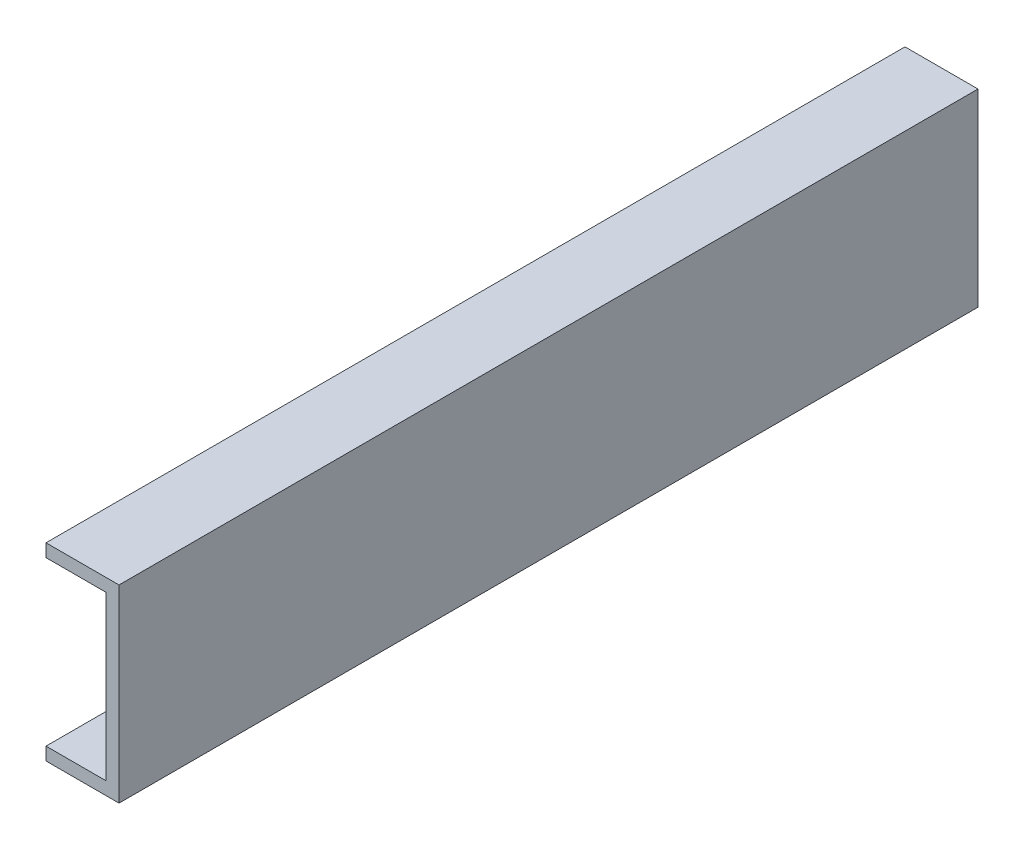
ISO-10303-21;
HEADER;
FILE_DESCRIPTION(('STEP AP214'),'2;1');
FILE_NAME('part.step','',(''),(''),'','','');
FILE_SCHEMA(('AUTOMOTIVE_DESIGN { 1 0 10303 214 1 1 1 1 }'));
ENDSEC;
DATA;
#1=APPLICATION_CONTEXT('core data for automotive mechanical design processes');
#2=APPLICATION_PROTOCOL_DEFINITION('international standard','automotive_design',2000,#1);
#3=PRODUCT_CONTEXT('',#1,'mechanical');
#4=PRODUCT('Part','Part','',(#3));
#5=PRODUCT_RELATED_PRODUCT_CATEGORY('part','',(#4));
#6=PRODUCT_DEFINITION_FORMATION('','',#4);
#7=PRODUCT_DEFINITION_CONTEXT('part definition',#1,'design');
#8=PRODUCT_DEFINITION('design','',#6,#7);
#9=PRODUCT_DEFINITION_SHAPE('','',#8);
#10=(LENGTH_UNIT() NAMED_UNIT(*) SI_UNIT(.MILLI.,.METRE.));
#11=(NAMED_UNIT(*) PLANE_ANGLE_UNIT() SI_UNIT($,.RADIAN.));
#12=(NAMED_UNIT(*) SI_UNIT($,.STERADIAN.) SOLID_ANGLE_UNIT());
#13=UNCERTAINTY_MEASURE_WITH_UNIT(LENGTH_MEASURE(1.E-05),#10,'distance_accuracy_value','');
#14=(GEOMETRIC_REPRESENTATION_CONTEXT(3) GLOBAL_UNCERTAINTY_ASSIGNED_CONTEXT((#13)) GLOBAL_UNIT_ASSIGNED_CONTEXT((#10,
#11,#12)) REPRESENTATION_CONTEXT('',''));
#15=CARTESIAN_POINT('',(0.,0.,0.));
#16=DIRECTION('',(0.,0.,1.));
#17=DIRECTION('',(1.,0.,0.));
#18=AXIS2_PLACEMENT_3D('',#15,#16,#17);
#19=CARTESIAN_POINT('',(0.,-19.,200.));
#20=DIRECTION('',(0.,-1.,0.));
#21=DIRECTION('',(0.,0.,-1.));
#22=AXIS2_PLACEMENT_3D('',#19,#20,#21);
#23=PLANE('',#22);
#24=DIRECTION('',(1.,0.,0.));
#25=VECTOR('',#24,1.);
#26=CARTESIAN_POINT('',(0.,-19.,0.));
#27=LINE('',#26,#25);
#28=CARTESIAN_POINT('',(-2.99999999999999,-19.,0.));
#29=VERTEX_POINT('',#28);
#30=CARTESIAN_POINT('',(-17.,-19.,0.));
#31=VERTEX_POINT('',#30);
#32=EDGE_CURVE('E99',#29,#31,#27,.F.);
#33=ORIENTED_EDGE('',*,*,#32,.T.);
#34=DIRECTION('',(0.,0.,-1.));
#35=VECTOR('',#34,1.);
#36=CARTESIAN_POINT('',(-17.,-19.,200.));
#37=LINE('',#36,#35);
#38=CARTESIAN_POINT('',(-17.,-19.,200.));
#39=VERTEX_POINT('',#38);
#40=EDGE_CURVE('E11',#39,#31,#37,.T.);
#41=ORIENTED_EDGE('',*,*,#40,.F.);
#42=DIRECTION('',(1.,0.,0.));
#43=VECTOR('',#42,1.);
#44=CARTESIAN_POINT('',(0.,-19.,200.));
#45=LINE('',#44,#43);
#46=CARTESIAN_POINT('',(-2.99999999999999,-19.,200.));
#47=VERTEX_POINT('',#46);
#48=EDGE_CURVE('E123',#47,#39,#45,.F.);
#49=ORIENTED_EDGE('',*,*,#48,.F.);
#50=DIRECTION('',(0.,0.,-1.));
#51=VECTOR('',#50,1.);
#52=CARTESIAN_POINT('',(-2.99999999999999,-19.,200.));
#53=LINE('',#52,#51);
#54=EDGE_CURVE('E100',#47,#29,#53,.T.);
#55=ORIENTED_EDGE('',*,*,#54,.T.);
#56=EDGE_LOOP('',(#33,#41,#49,#55));
#57=FACE_BOUND('',#56,.T.);
#58=ADVANCED_FACE('F24',(#57),#23,.F.);
#59=CARTESIAN_POINT('',(-17.,-22.,200.));
#60=DIRECTION('',(-1.,0.,0.));
#61=DIRECTION('',(0.,0.,1.));
#62=AXIS2_PLACEMENT_3D('',#59,#60,#61);
#63=PLANE('',#62);
#64=DIRECTION('',(0.,1.,0.));
#65=VECTOR('',#64,1.);
#66=CARTESIAN_POINT('',(-17.,-22.,0.));
#67=LINE('',#66,#65);
#68=CARTESIAN_POINT('',(-17.,-22.,0.));
#69=VERTEX_POINT('',#68);
#70=EDGE_CURVE('E91',#69,#31,#67,.T.);
#71=ORIENTED_EDGE('',*,*,#70,.F.);
#72=DIRECTION('',(0.,0.,-1.));
#73=VECTOR('',#72,1.);
#74=CARTESIAN_POINT('',(-17.,-22.,200.));
#75=LINE('',#74,#73);
#76=CARTESIAN_POINT('',(-17.,-22.,200.));
#77=VERTEX_POINT('',#76);
#78=EDGE_CURVE('E31',#77,#69,#75,.T.);
#79=ORIENTED_EDGE('',*,*,#78,.F.);
#80=DIRECTION('',(0.,1.,0.));
#81=VECTOR('',#80,1.);
#82=CARTESIAN_POINT('',(-17.,-22.,200.));
#83=LINE('',#82,#81);
#84=EDGE_CURVE('E94',#77,#39,#83,.T.);
#85=ORIENTED_EDGE('',*,*,#84,.T.);
#86=ORIENTED_EDGE('',*,*,#40,.T.);
#87=EDGE_LOOP('',(#71,#79,#85,#86));
#88=FACE_BOUND('',#87,.T.);
#89=ADVANCED_FACE('F89',(#88),#63,.T.);
#90=CARTESIAN_POINT('',(0.,-22.,200.));
#91=DIRECTION('',(0.,-1.,0.));
#92=DIRECTION('',(0.,0.,-1.));
#93=AXIS2_PLACEMENT_3D('',#90,#91,#92);
#94=PLANE('',#93);
#95=DIRECTION('',(-1.,0.,0.));
#96=VECTOR('',#95,1.);
#97=CARTESIAN_POINT('',(0.,-22.,0.));
#98=LINE('',#97,#96);
#99=CARTESIAN_POINT('',(0.,-22.,0.));
#100=VERTEX_POINT('',#99);
#101=EDGE_CURVE('E107',#100,#69,#98,.T.);
#102=ORIENTED_EDGE('',*,*,#101,.F.);
#103=DIRECTION('',(0.,0.,-1.));
#104=VECTOR('',#103,1.);
#105=CARTESIAN_POINT('',(0.,-22.,200.));
#106=LINE('',#105,#104);
#107=CARTESIAN_POINT('',(0.,-22.,200.));
#108=VERTEX_POINT('',#107);
#109=EDGE_CURVE('E150',#108,#100,#106,.T.);
#110=ORIENTED_EDGE('',*,*,#109,.F.);
#111=DIRECTION('',(-1.,0.,0.));
#112=VECTOR('',#111,1.);
#113=CARTESIAN_POINT('',(0.,-22.,200.));
#114=LINE('',#113,#112);
#115=EDGE_CURVE('E126',#108,#77,#114,.T.);
#116=ORIENTED_EDGE('',*,*,#115,.T.);
#117=ORIENTED_EDGE('',*,*,#78,.T.);
#118=EDGE_LOOP('',(#102,#110,#116,#117));
#119=FACE_BOUND('',#118,.T.);
#120=ADVANCED_FACE('F152',(#119),#94,.T.);
#121=CARTESIAN_POINT('',(0.,22.,200.));
#122=DIRECTION('',(1.,0.,0.));
#123=DIRECTION('',(0.,0.,-1.));
#124=AXIS2_PLACEMENT_3D('',#121,#122,#123);
#125=PLANE('',#124);
#126=DIRECTION('',(0.,-1.,0.));
#127=VECTOR('',#126,1.);
#128=CARTESIAN_POINT('',(0.,22.,0.));
#129=LINE('',#128,#127);
#130=CARTESIAN_POINT('',(0.,22.,0.));
#131=VERTEX_POINT('',#130);
#132=EDGE_CURVE('E109',#131,#100,#129,.T.);
#133=ORIENTED_EDGE('',*,*,#132,.F.);
#134=DIRECTION('',(0.,0.,-1.));
#135=VECTOR('',#134,1.);
#136=CARTESIAN_POINT('',(0.,22.,200.));
#137=LINE('',#136,#135);
#138=CARTESIAN_POINT('',(0.,22.,200.));
#139=VERTEX_POINT('',#138);
#140=EDGE_CURVE('E148',#139,#131,#137,.T.);
#141=ORIENTED_EDGE('',*,*,#140,.F.);
#142=DIRECTION('',(0.,-1.,0.));
#143=VECTOR('',#142,1.);
#144=CARTESIAN_POINT('',(0.,22.,200.));
#145=LINE('',#144,#143);
#146=EDGE_CURVE('E129',#139,#108,#145,.T.);
#147=ORIENTED_EDGE('',*,*,#146,.T.);
#148=ORIENTED_EDGE('',*,*,#109,.T.);
#149=EDGE_LOOP('',(#133,#141,#147,#148));
#150=FACE_BOUND('',#149,.T.);
#151=ADVANCED_FACE('F159',(#150),#125,.T.);
#152=CARTESIAN_POINT('',(-17.,22.,200.));
#153=DIRECTION('',(0.,1.,0.));
#154=DIRECTION('',(0.,0.,1.));
#155=AXIS2_PLACEMENT_3D('',#152,#153,#154);
#156=PLANE('',#155);
#157=DIRECTION('',(1.,0.,0.));
#158=VECTOR('',#157,1.);
#159=CARTESIAN_POINT('',(-17.,22.,0.));
#160=LINE('',#159,#158);
#161=CARTESIAN_POINT('',(-17.,22.,0.));
#162=VERTEX_POINT('',#161);
#163=EDGE_CURVE('E113',#162,#131,#160,.T.);
#164=ORIENTED_EDGE('',*,*,#163,.F.);
#165=DIRECTION('',(0.,0.,-1.));
#166=VECTOR('',#165,1.);
#167=CARTESIAN_POINT('',(-17.,22.,200.));
#168=LINE('',#167,#166);
#169=CARTESIAN_POINT('',(-17.,22.,200.));
#170=VERTEX_POINT('',#169);
#171=EDGE_CURVE('E146',#170,#162,#168,.T.);
#172=ORIENTED_EDGE('',*,*,#171,.F.);
#173=DIRECTION('',(1.,0.,0.));
#174=VECTOR('',#173,1.);
#175=CARTESIAN_POINT('',(-17.,22.,200.));
#176=LINE('',#175,#174);
#177=EDGE_CURVE('E132',#170,#139,#176,.T.);
#178=ORIENTED_EDGE('',*,*,#177,.T.);
#179=ORIENTED_EDGE('',*,*,#140,.T.);
#180=EDGE_LOOP('',(#164,#172,#178,#179));
#181=FACE_BOUND('',#180,.T.);
#182=ADVANCED_FACE('F162',(#181),#156,.T.);
#183=CARTESIAN_POINT('',(-17.,19.,200.));
#184=DIRECTION('',(-1.,0.,0.));
#185=DIRECTION('',(0.,0.,1.));
#186=AXIS2_PLACEMENT_3D('',#183,#184,#185);
#187=PLANE('',#186);
#188=DIRECTION('',(0.,1.,0.));
#189=VECTOR('',#188,1.);
#190=CARTESIAN_POINT('',(-17.,19.,0.));
#191=LINE('',#190,#189);
#192=CARTESIAN_POINT('',(-17.,19.,0.));
#193=VERTEX_POINT('',#192);
#194=EDGE_CURVE('E116',#193,#162,#191,.T.);
#195=ORIENTED_EDGE('',*,*,#194,.F.);
#196=DIRECTION('',(0.,0.,-1.));
#197=VECTOR('',#196,1.);
#198=CARTESIAN_POINT('',(-17.,19.,200.));
#199=LINE('',#198,#197);
#200=CARTESIAN_POINT('',(-17.,19.,200.));
#201=VERTEX_POINT('',#200);
#202=EDGE_CURVE('E144',#201,#193,#199,.T.);
#203=ORIENTED_EDGE('',*,*,#202,.F.);
#204=DIRECTION('',(0.,1.,0.));
#205=VECTOR('',#204,1.);
#206=CARTESIAN_POINT('',(-17.,19.,200.));
#207=LINE('',#206,#205);
#208=EDGE_CURVE('E135',#201,#170,#207,.T.);
#209=ORIENTED_EDGE('',*,*,#208,.T.);
#210=ORIENTED_EDGE('',*,*,#171,.T.);
#211=EDGE_LOOP('',(#195,#203,#209,#210));
#212=FACE_BOUND('',#211,.T.);
#213=ADVANCED_FACE('F165',(#212),#187,.T.);
#214=CARTESIAN_POINT('',(-17.,19.,200.));
#215=DIRECTION('',(0.,1.,0.));
#216=DIRECTION('',(0.,0.,1.));
#217=AXIS2_PLACEMENT_3D('',#214,#215,#216);
#218=PLANE('',#217);
#219=DIRECTION('',(1.,0.,0.));
#220=VECTOR('',#219,1.);
#221=CARTESIAN_POINT('',(-17.,19.,0.));
#222=LINE('',#221,#220);
#223=CARTESIAN_POINT('',(-2.99999999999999,19.,0.));
#224=VERTEX_POINT('',#223);
#225=EDGE_CURVE('E119',#193,#224,#222,.T.);
#226=ORIENTED_EDGE('',*,*,#225,.T.);
#227=DIRECTION('',(0.,0.,-1.));
#228=VECTOR('',#227,1.);
#229=CARTESIAN_POINT('',(-2.99999999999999,19.,200.));
#230=LINE('',#229,#228);
#231=CARTESIAN_POINT('',(-2.99999999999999,19.,200.));
#232=VERTEX_POINT('',#231);
#233=EDGE_CURVE('E141',#232,#224,#230,.T.);
#234=ORIENTED_EDGE('',*,*,#233,.F.);
#235=DIRECTION('',(1.,0.,0.));
#236=VECTOR('',#235,1.);
#237=CARTESIAN_POINT('',(-17.,19.,200.));
#238=LINE('',#237,#236);
#239=EDGE_CURVE('E43',#201,#232,#238,.T.);
#240=ORIENTED_EDGE('',*,*,#239,.F.);
#241=ORIENTED_EDGE('',*,*,#202,.T.);
#242=EDGE_LOOP('',(#226,#234,#240,#241));
#243=FACE_BOUND('',#242,.T.);
#244=ADVANCED_FACE('F168',(#243),#218,.F.);
#245=CARTESIAN_POINT('',(-2.99999999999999,22.,200.));
#246=DIRECTION('',(1.,0.,0.));
#247=DIRECTION('',(0.,0.,-1.));
#248=AXIS2_PLACEMENT_3D('',#245,#246,#247);
#249=PLANE('',#248);
#250=DIRECTION('',(0.,1.,0.));
#251=VECTOR('',#250,1.);
#252=CARTESIAN_POINT('',(-2.99999999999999,22.,0.));
#253=LINE('',#252,#251);
#254=EDGE_CURVE('E121',#224,#29,#253,.F.);
#255=ORIENTED_EDGE('',*,*,#254,.T.);
#256=ORIENTED_EDGE('',*,*,#54,.F.);
#257=DIRECTION('',(0.,1.,0.));
#258=VECTOR('',#257,1.);
#259=CARTESIAN_POINT('',(-2.99999999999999,22.,200.));
#260=LINE('',#259,#258);
#261=EDGE_CURVE('E38',#232,#47,#260,.F.);
#262=ORIENTED_EDGE('',*,*,#261,.F.);
#263=ORIENTED_EDGE('',*,*,#233,.T.);
#264=EDGE_LOOP('',(#255,#256,#262,#263));
#265=FACE_BOUND('',#264,.T.);
#266=ADVANCED_FACE('F170',(#265),#249,.F.);
#267=CARTESIAN_POINT('',(-17.,-19.,200.));
#268=DIRECTION('',(0.,0.,1.));
#269=DIRECTION('',(1.,0.,0.));
#270=AXIS2_PLACEMENT_3D('',#267,#268,#269);
#271=PLANE('',#270);
#272=ORIENTED_EDGE('',*,*,#48,.T.);
#273=ORIENTED_EDGE('',*,*,#84,.F.);
#274=ORIENTED_EDGE('',*,*,#115,.F.);
#275=ORIENTED_EDGE('',*,*,#146,.F.);
#276=ORIENTED_EDGE('',*,*,#177,.F.);
#277=ORIENTED_EDGE('',*,*,#208,.F.);
#278=ORIENTED_EDGE('',*,*,#239,.T.);
#279=ORIENTED_EDGE('',*,*,#261,.T.);
#280=EDGE_LOOP('',(#272,#273,#274,#275,#276,#277,#278,#279));
#281=FACE_BOUND('',#280,.T.);
#282=ADVANCED_FACE('F154',(#281),#271,.T.);
#283=CARTESIAN_POINT('',(-17.,-19.,0.));
#284=DIRECTION('',(0.,0.,1.));
#285=DIRECTION('',(1.,0.,0.));
#286=AXIS2_PLACEMENT_3D('',#283,#284,#285);
#287=PLANE('',#286);
#288=ORIENTED_EDGE('',*,*,#32,.F.);
#289=ORIENTED_EDGE('',*,*,#254,.F.);
#290=ORIENTED_EDGE('',*,*,#225,.F.);
#291=ORIENTED_EDGE('',*,*,#194,.T.);
#292=ORIENTED_EDGE('',*,*,#163,.T.);
#293=ORIENTED_EDGE('',*,*,#132,.T.);
#294=ORIENTED_EDGE('',*,*,#101,.T.);
#295=ORIENTED_EDGE('',*,*,#70,.T.);
#296=EDGE_LOOP('',(#288,#289,#290,#291,#292,#293,#294,#295));
#297=FACE_BOUND('',#296,.T.);
#298=ADVANCED_FACE('F104',(#297),#287,.F.);
#299=CLOSED_SHELL('',(#58,#89,#120,#151,#182,#213,#244,#266,#282,#298));
#300=MANIFOLD_SOLID_BREP('B2',#299);
#301=ADVANCED_BREP_SHAPE_REPRESENTATION('',(#18,#300),#14);
#302=SHAPE_DEFINITION_REPRESENTATION(#9,#301);
ENDSEC;
END-ISO-10303-21;
